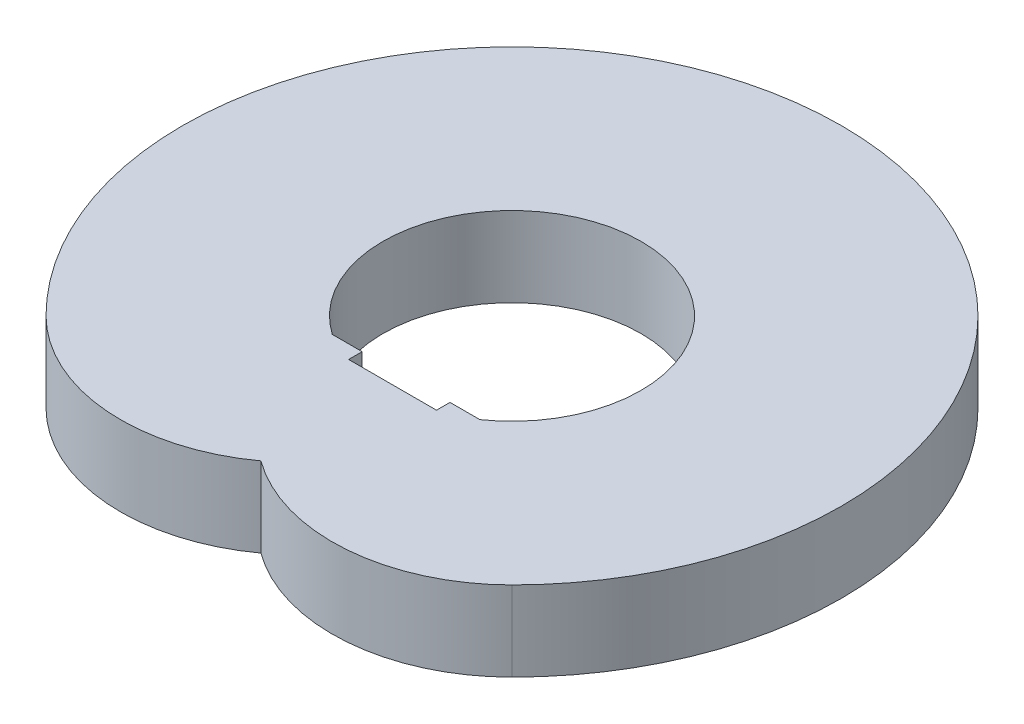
from build123d import *

# Parameters (mm, degrees)
EXTRUDE_1_DEPTH = 200


with BuildPart() as part:
    # Sketch 1 → Extrude 1 (new body)
    with BuildSketch(Plane(origin=(0, 0, 0), x_dir=(1, 0, 0), z_dir=(0, 1, 0))):
        with BuildLine():
            ThreePointArc((583.363094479, -583.363094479), (0, 825), (-583.363094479, -583.363094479))
            ThreePointArc((-583.363094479, -583.363094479), (-300.063671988, -713.809763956), (0, -628.741032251))
            ThreePointArc((0, -628.741032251), (300.063671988, -713.809763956), (583.363094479, -583.363094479))
        make_face()
        with BuildLine():
            Line((-110, -265.165042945), (-110, -299))
            Line((-110, -299), (110, -299))
            Line((110, -299), (110, -265.165042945))
            Line((110, -265.165042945), (184.834957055, -265.165042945))
            ThreePointArc((184.834957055, -265.165042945), (0, 323.22818774), (-184.834957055, -265.165042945))
            Line((-184.834957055, -265.165042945), (-110, -265.165042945))
        make_face(mode=Mode.SUBTRACT)
    extrude(amount=EXTRUDE_1_DEPTH)


solid = part.part
